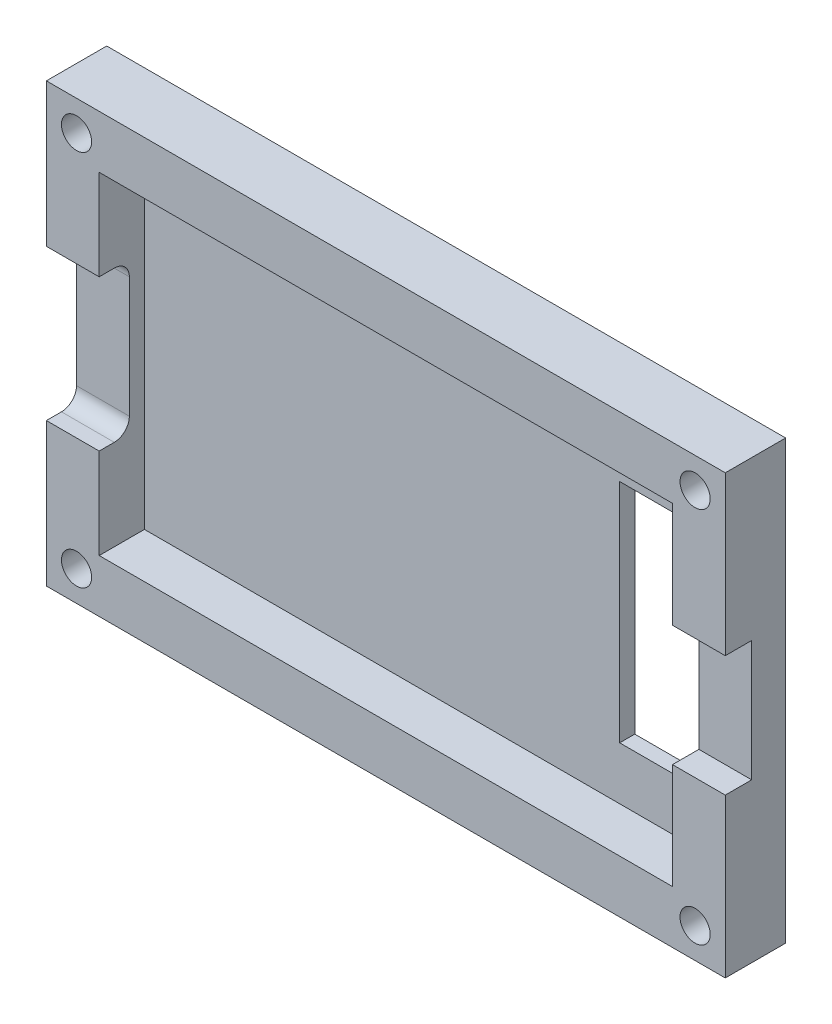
from build123d import *

# Parameters (mm, degrees)
SKETCH1_W           = 45
SKETCH1_H           = 29
BOSS_EXTRUDE1_DEPTH = 4
SKETCH5_W           = 38
SKETCH5_H           = 22
CUT_EXTRUDE2_DEPTH  = 3
SKETCH6_R           = 1
SKETCH6_W           = 6.5
SKETCH6_H           = 15
CUT_EXTRUDE3_DEPTH  = 12
CUT_EXTRUDE4_DEPTH  = 12
SKETCH8_W           = 3.5
SKETCH8_H           = 8
CUT_EXTRUDE5_DEPTH  = 12


with BuildPart() as part:
    # Sketch1 → Boss-Extrude1 (new body)
    with BuildSketch(Plane.XY):
        Rectangle(SKETCH1_W, SKETCH1_H)
    extrude(amount=BOSS_EXTRUDE1_DEPTH)

    # Sketch5 → Cut-Extrude2 (cut)
    with BuildSketch(Plane.XY.offset(4)):
        Rectangle(SKETCH5_W, SKETCH5_H)
    extrude(amount=-CUT_EXTRUDE2_DEPTH, mode=Mode.SUBTRACT)

    # Sketch6 → Cut-Extrude3 (cut)
    with BuildSketch(Plane.XY.offset(4)):
        with Locations((-20.5, 12.5)):
            Circle(SKETCH6_R)
        with Locations(Location((20.5, 12.5, 0), (0, 0, 180))):
            Circle(SKETCH6_R)
        with Locations((20.5, -12.5)):
            Circle(SKETCH6_R)
        with Locations(Location((-20.5, -12.5, 0), (0, 0, 180))):
            Circle(SKETCH6_R)
        with Locations((15.75, 0)):
            Rectangle(SKETCH6_W, SKETCH6_H)
    extrude(amount=-CUT_EXTRUDE3_DEPTH, mode=Mode.SUBTRACT)

    # Sketch7 → Cut-Extrude4 (cut)
    with BuildSketch(Plane.ZY.offset(22.5)):
        with BuildLine():
            Line((3, -5), (5, -5))
            ThreePointArc((5, -5), (5.707106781, -4.707106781), (6, -4))
            Line((6, -4), (6, 4))
            ThreePointArc((6, 4), (5.707106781, 4.707106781), (5, 5))
            Line((5, 5), (3, 5))
            ThreePointArc((3, 5), (2.292893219, 4.707106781), (2, 4))
            Line((2, 4), (2, -4))
            ThreePointArc((2, -4), (2.292893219, -4.707106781), (3, -5))
        make_face()
    extrude(amount=-CUT_EXTRUDE4_DEPTH, mode=Mode.SUBTRACT)

    # Sketch8 → Cut-Extrude5 (cut)
    with BuildSketch(Plane(origin=(22.5, 0, 0), x_dir=(0, 0, -1), z_dir=(1, 0, 0))):
        with Locations((-4, 0)):
            Rectangle(SKETCH8_W, SKETCH8_H)
    extrude(amount=-CUT_EXTRUDE5_DEPTH, mode=Mode.SUBTRACT)


solid = part.part
